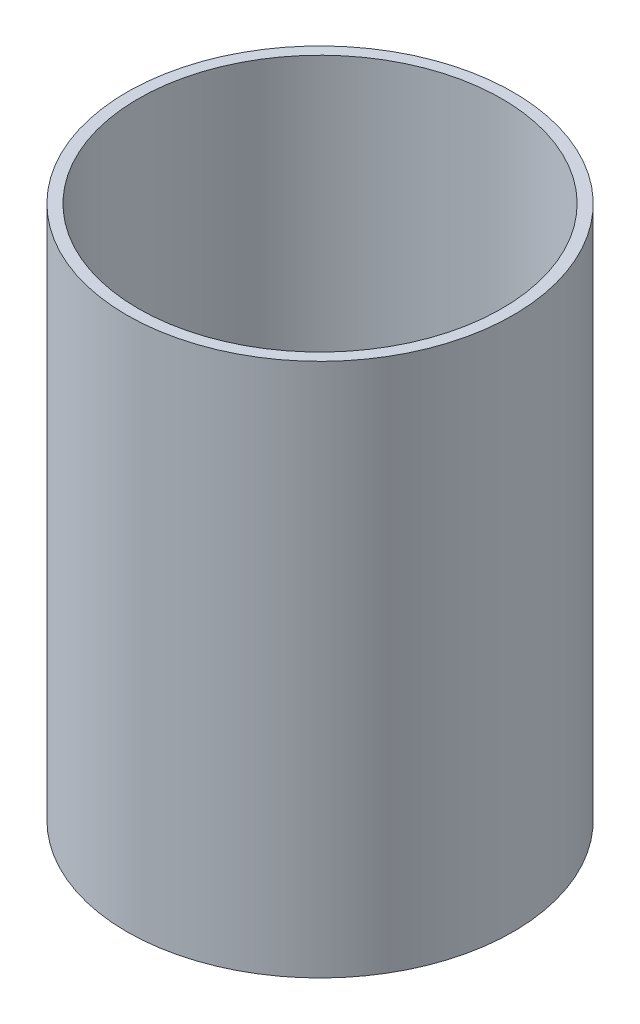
from build123d import *

# Parameters (mm, degrees)
SKETCH2_R           = 107.95
SKETCH2_R_2         = 101.6
BOSS_EXTRUDE1_DEPTH = 298.45


with BuildPart() as part:
    # Sketch2 → Boss-Extrude1 (new body)
    with BuildSketch(Plane(origin=(0, 0, 0), x_dir=(1, 0, 0), z_dir=(0, 1, 0))):
        with Locations(Location((0, 0, 0), (0, 0, 270))):
            Circle(SKETCH2_R)
        with Locations(Location((0, 0, 0), (0, 0, 270))):
            Circle(SKETCH2_R_2, mode=Mode.SUBTRACT)
    extrude(amount=BOSS_EXTRUDE1_DEPTH)


solid = part.part
